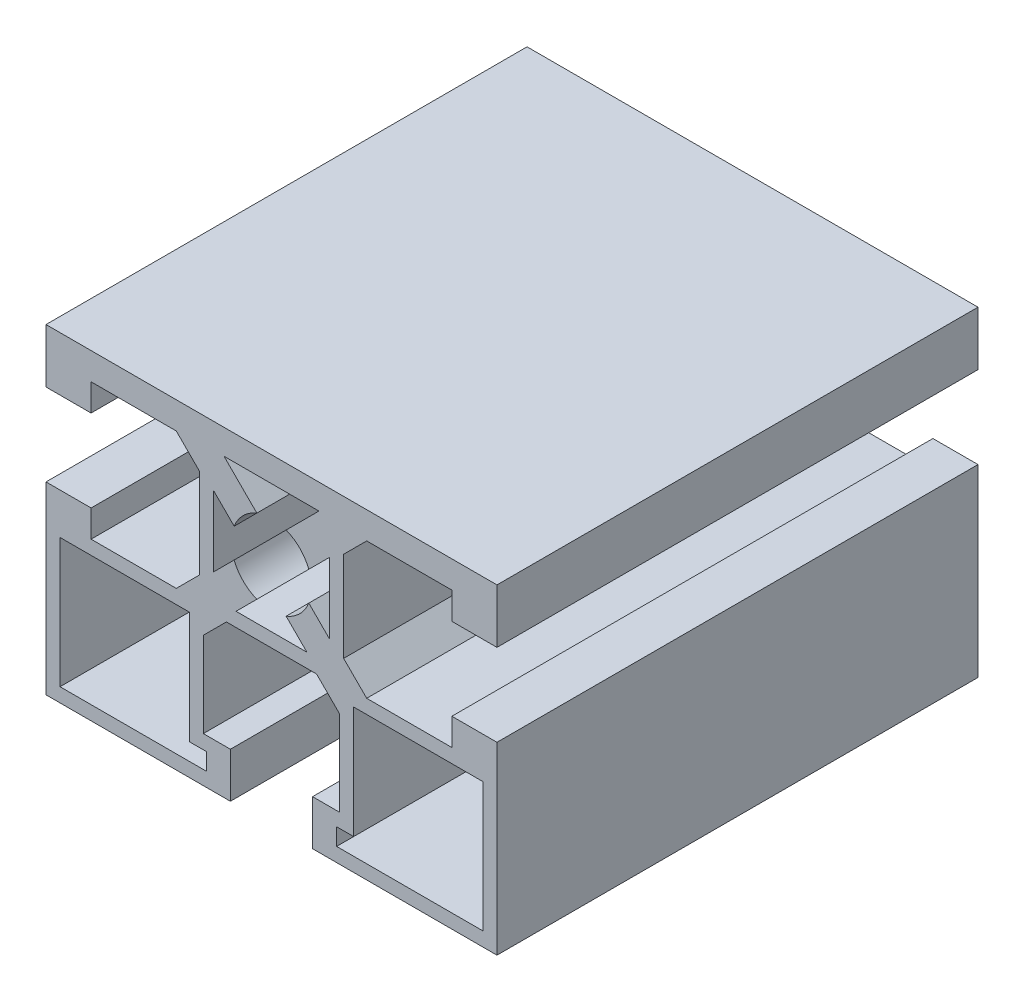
from build123d import *

# Parameters (mm, degrees)
EXTRUDE1_DEPTH = 48
SKETCH2_R      = 4.0005
EXTRUDE2_DEPTH = 58.589066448


with BuildPart() as part:
    # Sketch1 → Extrude1 (new body)
    with BuildSketch(Plane.XY):
        Polygon((-22.499994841, 9.499992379), (-22.499994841, 4.099992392), (-17.999994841, 4.099992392), (-17.999994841, 6.799992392), (-9.499994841, 6.799992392), (-7.199994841, 4.499992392), (-7.199994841, -4.500007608), (-9.499994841, -6.800007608), (-17.999994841, -6.800007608), (-17.999994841, -4.100007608), (-22.499994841, -4.100007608), (-22.499994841, -22.500007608), (-4.099994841, -22.500007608), (-4.099994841, -18.000007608), (-6.799994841, -18.000007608), (-6.799994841, -9.500007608), (-4.499994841, -7.200007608), (4.500005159, -7.200007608), (6.800005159, -9.500007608), (6.800005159, -18.000007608), (4.100005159, -18.000007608), (4.100005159, -22.500007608), (22.500005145, -22.500007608), (22.500005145, -4.100007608), (18.000005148, -4.100007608), (18.000005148, -6.800007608), (9.500005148, -6.800007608), (7.200005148, -4.500007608), (7.200005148, 4.499992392), (9.500005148, 6.799992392), (18.000005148, 6.799992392), (18.000005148, 4.099992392), (22.500005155, 4.099992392), (22.500005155, 9.499992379), align=None)
        Polygon((-8.199985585, -19.40000761), (-6.500001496, -19.40000761), (-6.500001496, -21.1), (-21.100003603, -21.1), (-21.100003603, -8.199995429), (-8.199999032, -8.199995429), align=None, mode=Mode.SUBTRACT)
        Polygon((6.500011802, -19.40000761), (8.199995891, -19.40000761), (8.200009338, -8.199995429), (21.100013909, -8.199995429), (21.100013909, -21.1), (6.500011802, -21.1), align=None, mode=Mode.SUBTRACT)
        with BuildLine():
            Line((-3.451121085, -1.18838683), (-5.799999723, -3.537265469))
            Line((-5.799999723, -3.537265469), (-5.799985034, 3.537266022))
            Line((-5.799985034, 3.537266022), (-3.451117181, 1.188398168))
            ThreePointArc((-3.451117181, 1.188398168), (-2.580938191, 2.580941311), (-1.188393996, 3.451118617))
            Line((-1.188393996, 3.451118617), (-4.737285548, 6.999995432))
            Line((-4.737285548, 6.999995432), (4.737285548, 6.999995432))
            Line((4.737285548, 6.999995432), (1.188393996, 3.451118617))
            ThreePointArc((1.188393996, 3.451118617), (2.580938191, 2.580941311), (3.451117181, 1.188398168))
            Line((3.451117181, 1.188398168), (5.799985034, 3.537266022))
            Line((5.799985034, 3.537266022), (5.799999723, -3.537265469))
            Line((5.799999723, -3.537265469), (3.451121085, -1.18838683))
            ThreePointArc((3.451121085, -1.18838683), (2.580942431, -2.580937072), (1.188393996, -3.451118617))
            Line((1.188393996, -3.451118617), (3.537277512, -5.799992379))
            Line((3.537277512, -5.799992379), (-3.537277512, -5.799992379))
            Line((-3.537277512, -5.799992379), (-1.188393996, -3.451118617))
            ThreePointArc((-1.188393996, -3.451118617), (-2.580942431, -2.580937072), (-3.451121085, -1.18838683))
        make_face(mode=Mode.SUBTRACT)
    extrude(amount=EXTRUDE1_DEPTH)

    # Sketch2 → Extrude2 (cut, through all)
    with BuildSketch(Plane.XY.offset(48)):
        Circle(SKETCH2_R)
    extrude(amount=-EXTRUDE2_DEPTH, mode=Mode.SUBTRACT)


solid = part.part
